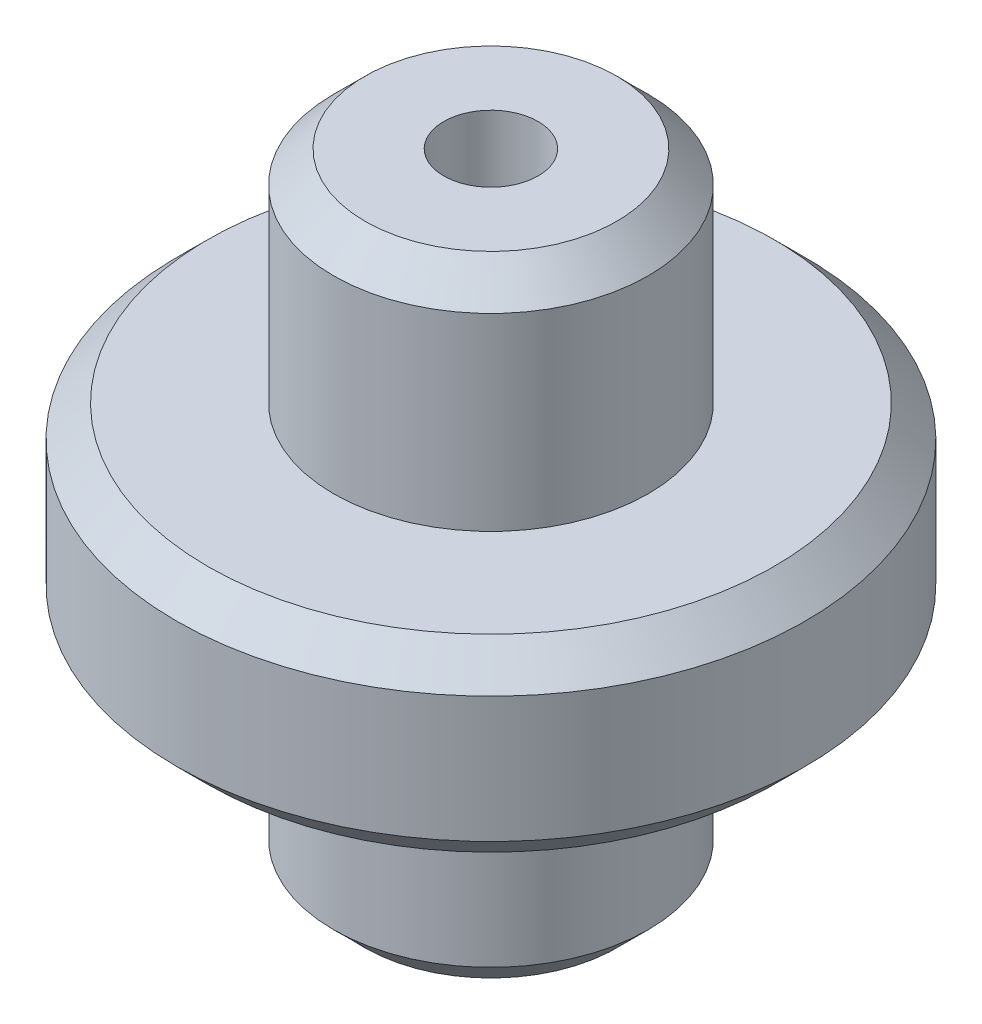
from build123d import *

# Parameters (mm, degrees)
SKETCH1_R          = 10
EXTRUDE1_DEPTH     = 6
SKETCH2_R          = 5
EXTRUDE2_DEPTH     = 7
EXTRUDE3_START     = 7
SKETCH3_R          = 5
EXTRUDE3_DEPTH     = 7
SKETCH4_R          = 1.5
CUT_EXTRUDE1_DEPTH = 25.494897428
CHAMFER1_SIZE      = 1


with BuildPart() as part:
    # Sketch1 → Extrude1 (new body)
    with BuildSketch(Plane(origin=(0, 0, 0), x_dir=(1, 0, 0), z_dir=(0, 1, 0))):
        with Locations(Location((0, 0, 0), (0, 0, 270))):
            Circle(SKETCH1_R)
    extrude(amount=EXTRUDE1_DEPTH)

    # Sketch2 → Extrude2 (add)
    with BuildSketch(Plane(origin=(0, 6, 0), x_dir=(-1, 0, 0), z_dir=(0, 1, 0))):
        with Locations(Location((0, 0, 0), (0, 0, 90))):
            Circle(SKETCH2_R)
    extrude(amount=EXTRUDE2_DEPTH)

    # Sketch3 → Extrude3 (add)
    with BuildSketch(Plane.XZ.offset(EXTRUDE3_START)):
        with Locations(Location((0, 0, 0), (0, 0, 90))):
            Circle(SKETCH3_R)
    extrude(amount=-EXTRUDE3_DEPTH)

    # Sketch4 → Cut-Extrude1 (cut, through all)
    with BuildSketch(Plane.XZ.offset(7)):
        with Locations(Location((0, 0, 0), (0, 0, 270))):
            Circle(SKETCH4_R)
    extrude(amount=-CUT_EXTRUDE1_DEPTH, mode=Mode.SUBTRACT)

    # Chamfer1
    chamfer1_edges = [part.edges().sort_by_distance(p)[0] for p in [
        (0, -7, -5),
        (0, 0, -10),
        (0, 6, -10),
        (0, 13, -5),
    ]]
    chamfer(chamfer1_edges, length=CHAMFER1_SIZE)


solid = part.part
